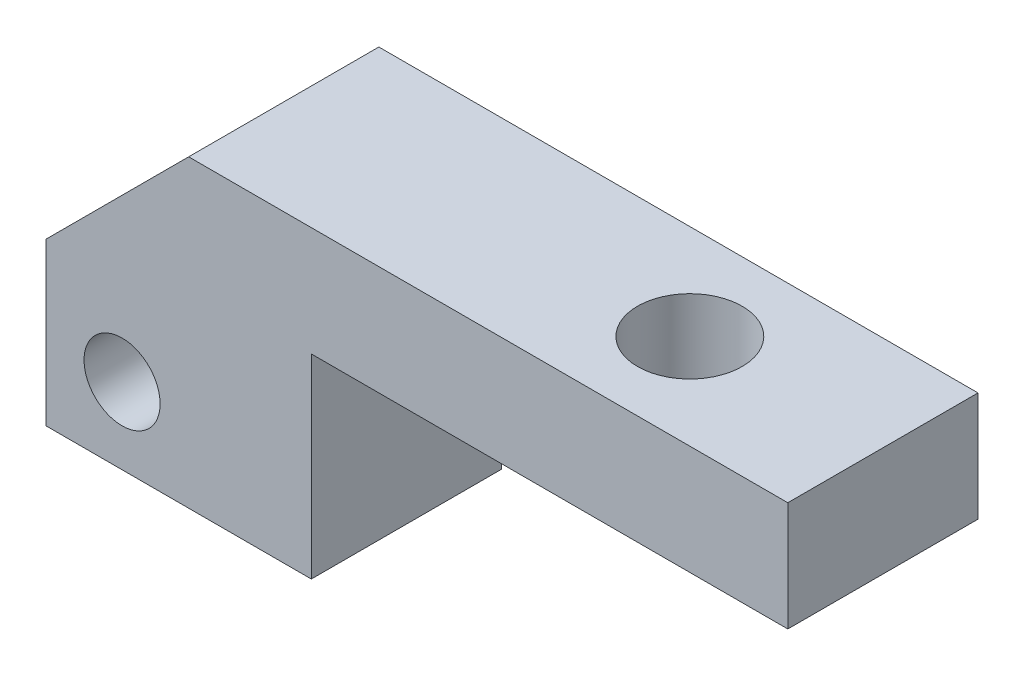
ISO-10303-21;
HEADER;
FILE_DESCRIPTION(('STEP AP214'),'2;1');
FILE_NAME('part.step','',(''),(''),'','','');
FILE_SCHEMA(('AUTOMOTIVE_DESIGN { 1 0 10303 214 1 1 1 1 }'));
ENDSEC;
DATA;
#1=APPLICATION_CONTEXT('core data for automotive mechanical design processes');
#2=APPLICATION_PROTOCOL_DEFINITION('international standard','automotive_design',2000,#1);
#3=PRODUCT_CONTEXT('',#1,'mechanical');
#4=PRODUCT('Part','Part','',(#3));
#5=PRODUCT_RELATED_PRODUCT_CATEGORY('part','',(#4));
#6=PRODUCT_DEFINITION_FORMATION('','',#4);
#7=PRODUCT_DEFINITION_CONTEXT('part definition',#1,'design');
#8=PRODUCT_DEFINITION('design','',#6,#7);
#9=PRODUCT_DEFINITION_SHAPE('','',#8);
#10=(LENGTH_UNIT() NAMED_UNIT(*) SI_UNIT(.MILLI.,.METRE.));
#11=(NAMED_UNIT(*) PLANE_ANGLE_UNIT() SI_UNIT($,.RADIAN.));
#12=(NAMED_UNIT(*) SI_UNIT($,.STERADIAN.) SOLID_ANGLE_UNIT());
#13=UNCERTAINTY_MEASURE_WITH_UNIT(LENGTH_MEASURE(1.E-05),#10,'distance_accuracy_value','');
#14=(GEOMETRIC_REPRESENTATION_CONTEXT(3) GLOBAL_UNCERTAINTY_ASSIGNED_CONTEXT((#13)) GLOBAL_UNIT_ASSIGNED_CONTEXT((#10,
#11,#12)) REPRESENTATION_CONTEXT('',''));
#15=CARTESIAN_POINT('',(0.,0.,0.));
#16=DIRECTION('',(0.,0.,1.));
#17=DIRECTION('',(1.,0.,0.));
#18=AXIS2_PLACEMENT_3D('',#15,#16,#17);
#19=CARTESIAN_POINT('',(0.,32.,10.));
#20=DIRECTION('',(0.,0.,1.));
#21=DIRECTION('',(1.,0.,0.));
#22=AXIS2_PLACEMENT_3D('',#19,#20,#21);
#23=PLANE('',#22);
#24=DIRECTION('',(-1.,0.,0.));
#25=VECTOR('',#24,1.);
#26=CARTESIAN_POINT('',(-27.9,32.,10.));
#27=LINE('',#26,#25);
#28=CARTESIAN_POINT('',(50.1,32.,10.));
#29=VERTEX_POINT('',#28);
#30=CARTESIAN_POINT('',(-12.9,32.,10.));
#31=VERTEX_POINT('',#30);
#32=EDGE_CURVE('E130',#29,#31,#27,.T.);
#33=ORIENTED_EDGE('',*,*,#32,.T.);
#34=DIRECTION('',(0.707106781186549,0.707106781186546,0.));
#35=VECTOR('',#34,1.);
#36=CARTESIAN_POINT('',(-6.44999999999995,38.45,10.));
#37=LINE('',#36,#35);
#38=CARTESIAN_POINT('',(-27.9,17.,10.));
#39=VERTEX_POINT('',#38);
#40=EDGE_CURVE('E11',#31,#39,#37,.F.);
#41=ORIENTED_EDGE('',*,*,#40,.T.);
#42=DIRECTION('',(0.,-1.,0.));
#43=VECTOR('',#42,1.);
#44=CARTESIAN_POINT('',(-27.9,0.,10.));
#45=LINE('',#44,#43);
#46=CARTESIAN_POINT('',(-27.9,0.,10.));
#47=VERTEX_POINT('',#46);
#48=EDGE_CURVE('E132',#39,#47,#45,.T.);
#49=ORIENTED_EDGE('',*,*,#48,.T.);
#50=DIRECTION('',(1.,0.,0.));
#51=VECTOR('',#50,1.);
#52=CARTESIAN_POINT('',(0.,0.,10.));
#53=LINE('',#52,#51);
#54=CARTESIAN_POINT('',(0.,0.,10.));
#55=VERTEX_POINT('',#54);
#56=EDGE_CURVE('E134',#47,#55,#53,.T.);
#57=ORIENTED_EDGE('',*,*,#56,.T.);
#58=DIRECTION('',(0.,1.,0.));
#59=VECTOR('',#58,1.);
#60=CARTESIAN_POINT('',(0.,20.5,10.));
#61=LINE('',#60,#59);
#62=CARTESIAN_POINT('',(0.,20.5,10.));
#63=VERTEX_POINT('',#62);
#64=EDGE_CURVE('E125',#55,#63,#61,.T.);
#65=ORIENTED_EDGE('',*,*,#64,.T.);
#66=DIRECTION('',(1.,0.,0.));
#67=VECTOR('',#66,1.);
#68=CARTESIAN_POINT('',(50.1,20.5,10.));
#69=LINE('',#68,#67);
#70=CARTESIAN_POINT('',(50.1,20.5,10.));
#71=VERTEX_POINT('',#70);
#72=EDGE_CURVE('E101',#63,#71,#69,.T.);
#73=ORIENTED_EDGE('',*,*,#72,.T.);
#74=DIRECTION('',(0.,1.,0.));
#75=VECTOR('',#74,1.);
#76=CARTESIAN_POINT('',(50.1,32.,10.));
#77=LINE('',#76,#75);
#78=EDGE_CURVE('E128',#71,#29,#77,.T.);
#79=ORIENTED_EDGE('',*,*,#78,.T.);
#80=EDGE_LOOP('',(#33,#41,#49,#57,#65,#73,#79));
#81=FACE_BOUND('',#80,.T.);
#82=CARTESIAN_POINT('',(-19.9,8.,10.));
#83=DIRECTION('',(0.,0.,1.));
#84=DIRECTION('',(1.,0.,0.));
#85=AXIS2_PLACEMENT_3D('',#82,#83,#84);
#86=CIRCLE('',#85,4.);
#87=CARTESIAN_POINT('',(-15.9,8.,10.));
#88=VERTEX_POINT('',#87);
#89=EDGE_CURVE('E111',#88,#88,#86,.T.);
#90=ORIENTED_EDGE('',*,*,#89,.F.);
#91=EDGE_LOOP('',(#90));
#92=FACE_BOUND('',#91,.T.);
#93=ADVANCED_FACE('F28',(#81,#92),#23,.T.);
#94=CARTESIAN_POINT('',(0.,32.,-10.));
#95=DIRECTION('',(0.,0.,1.));
#96=DIRECTION('',(1.,0.,0.));
#97=AXIS2_PLACEMENT_3D('',#94,#95,#96);
#98=PLANE('',#97);
#99=DIRECTION('',(0.,-1.,0.));
#100=VECTOR('',#99,1.);
#101=CARTESIAN_POINT('',(-27.9,0.,-10.));
#102=LINE('',#101,#100);
#103=CARTESIAN_POINT('',(-27.9,17.,-10.));
#104=VERTEX_POINT('',#103);
#105=CARTESIAN_POINT('',(-27.9,0.,-10.));
#106=VERTEX_POINT('',#105);
#107=EDGE_CURVE('E121',#104,#106,#102,.T.);
#108=ORIENTED_EDGE('',*,*,#107,.F.);
#109=DIRECTION('',(-0.707106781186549,-0.707106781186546,0.));
#110=VECTOR('',#109,1.);
#111=CARTESIAN_POINT('',(-27.9,17.,-10.));
#112=LINE('',#111,#110);
#113=CARTESIAN_POINT('',(-12.8999999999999,32.,-10.));
#114=VERTEX_POINT('',#113);
#115=EDGE_CURVE('E50',#104,#114,#112,.F.);
#116=ORIENTED_EDGE('',*,*,#115,.T.);
#117=DIRECTION('',(-1.,0.,0.));
#118=VECTOR('',#117,1.);
#119=CARTESIAN_POINT('',(-27.9,32.,-10.));
#120=LINE('',#119,#118);
#121=CARTESIAN_POINT('',(50.1,32.,-10.));
#122=VERTEX_POINT('',#121);
#123=EDGE_CURVE('E119',#122,#114,#120,.T.);
#124=ORIENTED_EDGE('',*,*,#123,.F.);
#125=DIRECTION('',(0.,1.,0.));
#126=VECTOR('',#125,1.);
#127=CARTESIAN_POINT('',(50.1,32.,-10.));
#128=LINE('',#127,#126);
#129=CARTESIAN_POINT('',(50.1,20.5,-10.));
#130=VERTEX_POINT('',#129);
#131=EDGE_CURVE('E93',#130,#122,#128,.T.);
#132=ORIENTED_EDGE('',*,*,#131,.F.);
#133=DIRECTION('',(1.,0.,0.));
#134=VECTOR('',#133,1.);
#135=CARTESIAN_POINT('',(50.1,20.5,-10.));
#136=LINE('',#135,#134);
#137=CARTESIAN_POINT('',(0.,20.5,-10.));
#138=VERTEX_POINT('',#137);
#139=EDGE_CURVE('E86',#138,#130,#136,.T.);
#140=ORIENTED_EDGE('',*,*,#139,.F.);
#141=DIRECTION('',(0.,1.,0.));
#142=VECTOR('',#141,1.);
#143=CARTESIAN_POINT('',(0.,20.5,-10.));
#144=LINE('',#143,#142);
#145=CARTESIAN_POINT('',(0.,0.,-10.));
#146=VERTEX_POINT('',#145);
#147=EDGE_CURVE('E92',#146,#138,#144,.T.);
#148=ORIENTED_EDGE('',*,*,#147,.F.);
#149=DIRECTION('',(1.,0.,0.));
#150=VECTOR('',#149,1.);
#151=CARTESIAN_POINT('',(0.,0.,-10.));
#152=LINE('',#151,#150);
#153=EDGE_CURVE('E123',#106,#146,#152,.T.);
#154=ORIENTED_EDGE('',*,*,#153,.F.);
#155=EDGE_LOOP('',(#108,#116,#124,#132,#140,#148,#154));
#156=FACE_BOUND('',#155,.T.);
#157=CARTESIAN_POINT('',(-19.9,8.,-10.));
#158=DIRECTION('',(0.,0.,1.));
#159=DIRECTION('',(1.,0.,0.));
#160=AXIS2_PLACEMENT_3D('',#157,#158,#159);
#161=CIRCLE('',#160,4.);
#162=CARTESIAN_POINT('',(-15.9,8.,-10.));
#163=VERTEX_POINT('',#162);
#164=EDGE_CURVE('E114',#163,#163,#161,.T.);
#165=ORIENTED_EDGE('',*,*,#164,.T.);
#166=EDGE_LOOP('',(#165));
#167=FACE_BOUND('',#166,.T.);
#168=ADVANCED_FACE('F88',(#156,#167),#98,.F.);
#169=CARTESIAN_POINT('',(0.,20.5,10.));
#170=DIRECTION('',(-1.,0.,0.));
#171=DIRECTION('',(0.,-1.,0.));
#172=AXIS2_PLACEMENT_3D('',#169,#170,#171);
#173=PLANE('',#172);
#174=ORIENTED_EDGE('',*,*,#147,.T.);
#175=DIRECTION('',(0.,0.,-1.));
#176=VECTOR('',#175,1.);
#177=CARTESIAN_POINT('',(0.,20.5,10.));
#178=LINE('',#177,#176);
#179=EDGE_CURVE('E99',#63,#138,#178,.T.);
#180=ORIENTED_EDGE('',*,*,#179,.F.);
#181=ORIENTED_EDGE('',*,*,#64,.F.);
#182=DIRECTION('',(0.,0.,-1.));
#183=VECTOR('',#182,1.);
#184=CARTESIAN_POINT('',(0.,0.,10.));
#185=LINE('',#184,#183);
#186=EDGE_CURVE('E110',#55,#146,#185,.T.);
#187=ORIENTED_EDGE('',*,*,#186,.T.);
#188=EDGE_LOOP('',(#174,#180,#181,#187));
#189=FACE_BOUND('',#188,.T.);
#190=ADVANCED_FACE('F30',(#189),#173,.F.);
#191=CARTESIAN_POINT('',(50.1,20.5,10.));
#192=DIRECTION('',(0.,1.,0.));
#193=DIRECTION('',(-1.,0.,0.));
#194=AXIS2_PLACEMENT_3D('',#191,#192,#193);
#195=PLANE('',#194);
#196=CARTESIAN_POINT('',(29.8,20.5,0.));
#197=DIRECTION('',(0.,1.,0.));
#198=DIRECTION('',(-1.,0.,0.));
#199=AXIS2_PLACEMENT_3D('',#196,#197,#198);
#200=CIRCLE('',#199,5.5);
#201=CARTESIAN_POINT('',(24.3,20.5,0.));
#202=VERTEX_POINT('',#201);
#203=EDGE_CURVE('E196',#202,#202,#200,.F.);
#204=ORIENTED_EDGE('',*,*,#203,.F.);
#205=EDGE_LOOP('',(#204));
#206=FACE_BOUND('',#205,.T.);
#207=ORIENTED_EDGE('',*,*,#139,.T.);
#208=DIRECTION('',(0.,0.,-1.));
#209=VECTOR('',#208,1.);
#210=CARTESIAN_POINT('',(50.1,20.5,10.));
#211=LINE('',#210,#209);
#212=EDGE_CURVE('E106',#71,#130,#211,.T.);
#213=ORIENTED_EDGE('',*,*,#212,.F.);
#214=ORIENTED_EDGE('',*,*,#72,.F.);
#215=ORIENTED_EDGE('',*,*,#179,.T.);
#216=EDGE_LOOP('',(#207,#213,#214,#215));
#217=FACE_BOUND('',#216,.T.);
#218=ADVANCED_FACE('F100',(#206,#217),#195,.F.);
#219=CARTESIAN_POINT('',(50.1,32.,10.));
#220=DIRECTION('',(-1.,0.,0.));
#221=DIRECTION('',(0.,0.,1.));
#222=AXIS2_PLACEMENT_3D('',#219,#220,#221);
#223=PLANE('',#222);
#224=ORIENTED_EDGE('',*,*,#131,.T.);
#225=DIRECTION('',(0.,0.,-1.));
#226=VECTOR('',#225,1.);
#227=CARTESIAN_POINT('',(50.1,32.,10.));
#228=LINE('',#227,#226);
#229=EDGE_CURVE('E140',#29,#122,#228,.T.);
#230=ORIENTED_EDGE('',*,*,#229,.F.);
#231=ORIENTED_EDGE('',*,*,#78,.F.);
#232=ORIENTED_EDGE('',*,*,#212,.T.);
#233=EDGE_LOOP('',(#224,#230,#231,#232));
#234=FACE_BOUND('',#233,.T.);
#235=ADVANCED_FACE('F186',(#234),#223,.F.);
#236=CARTESIAN_POINT('',(-27.9,32.,10.));
#237=DIRECTION('',(0.,-1.,0.));
#238=DIRECTION('',(0.,0.,-1.));
#239=AXIS2_PLACEMENT_3D('',#236,#237,#238);
#240=PLANE('',#239);
#241=CARTESIAN_POINT('',(29.8,32.,0.));
#242=DIRECTION('',(0.,1.,0.));
#243=DIRECTION('',(0.,0.,1.));
#244=AXIS2_PLACEMENT_3D('',#241,#242,#243);
#245=CIRCLE('',#244,5.5);
#246=CARTESIAN_POINT('',(29.8,32.,5.5));
#247=VERTEX_POINT('',#246);
#248=EDGE_CURVE('E198',#247,#247,#245,.T.);
#249=ORIENTED_EDGE('',*,*,#248,.F.);
#250=EDGE_LOOP('',(#249));
#251=FACE_BOUND('',#250,.T.);
#252=ORIENTED_EDGE('',*,*,#123,.T.);
#253=DIRECTION('',(0.,0.,1.));
#254=VECTOR('',#253,1.);
#255=CARTESIAN_POINT('',(-12.8999999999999,32.,10.));
#256=LINE('',#255,#254);
#257=EDGE_CURVE('E36',#114,#31,#256,.T.);
#258=ORIENTED_EDGE('',*,*,#257,.T.);
#259=ORIENTED_EDGE('',*,*,#32,.F.);
#260=ORIENTED_EDGE('',*,*,#229,.T.);
#261=EDGE_LOOP('',(#252,#258,#259,#260));
#262=FACE_BOUND('',#261,.T.);
#263=ADVANCED_FACE('F183',(#251,#262),#240,.F.);
#264=CARTESIAN_POINT('',(-27.9,0.,10.));
#265=DIRECTION('',(1.,0.,0.));
#266=DIRECTION('',(0.,0.,-1.));
#267=AXIS2_PLACEMENT_3D('',#264,#265,#266);
#268=PLANE('',#267);
#269=ORIENTED_EDGE('',*,*,#48,.F.);
#270=DIRECTION('',(0.,0.,-1.));
#271=VECTOR('',#270,1.);
#272=CARTESIAN_POINT('',(-27.9,17.,10.));
#273=LINE('',#272,#271);
#274=EDGE_CURVE('E105',#39,#104,#273,.T.);
#275=ORIENTED_EDGE('',*,*,#274,.T.);
#276=ORIENTED_EDGE('',*,*,#107,.T.);
#277=DIRECTION('',(0.,0.,-1.));
#278=VECTOR('',#277,1.);
#279=CARTESIAN_POINT('',(-27.9,0.,10.));
#280=LINE('',#279,#278);
#281=EDGE_CURVE('E137',#47,#106,#280,.T.);
#282=ORIENTED_EDGE('',*,*,#281,.F.);
#283=EDGE_LOOP('',(#269,#275,#276,#282));
#284=FACE_BOUND('',#283,.T.);
#285=ADVANCED_FACE('F149',(#284),#268,.F.);
#286=CARTESIAN_POINT('',(0.,0.,10.));
#287=DIRECTION('',(0.,1.,0.));
#288=DIRECTION('',(-1.,0.,0.));
#289=AXIS2_PLACEMENT_3D('',#286,#287,#288);
#290=PLANE('',#289);
#291=ORIENTED_EDGE('',*,*,#153,.T.);
#292=ORIENTED_EDGE('',*,*,#186,.F.);
#293=ORIENTED_EDGE('',*,*,#56,.F.);
#294=ORIENTED_EDGE('',*,*,#281,.T.);
#295=EDGE_LOOP('',(#291,#292,#293,#294));
#296=FACE_BOUND('',#295,.T.);
#297=ADVANCED_FACE('F154',(#296),#290,.F.);
#298=CARTESIAN_POINT('',(-19.9,8.,10.));
#299=DIRECTION('',(0.,0.,-1.));
#300=DIRECTION('',(-1.,0.,0.));
#301=AXIS2_PLACEMENT_3D('',#298,#299,#300);
#302=CYLINDRICAL_SURFACE('',#301,4.);
#303=ORIENTED_EDGE('',*,*,#89,.T.);
#304=EDGE_LOOP('',(#303));
#305=FACE_BOUND('',#304,.T.);
#306=ORIENTED_EDGE('',*,*,#164,.F.);
#307=EDGE_LOOP('',(#306));
#308=FACE_BOUND('',#307,.T.);
#309=ADVANCED_FACE('F161',(#305,#308),#302,.F.);
#310=CARTESIAN_POINT('',(-27.9,17.,10.));
#311=DIRECTION('',(0.707106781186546,-0.707106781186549,0.));
#312=DIRECTION('',(0.707106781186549,0.707106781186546,0.));
#313=AXIS2_PLACEMENT_3D('',#310,#311,#312);
#314=PLANE('',#313);
#315=ORIENTED_EDGE('',*,*,#40,.F.);
#316=ORIENTED_EDGE('',*,*,#257,.F.);
#317=ORIENTED_EDGE('',*,*,#115,.F.);
#318=ORIENTED_EDGE('',*,*,#274,.F.);
#319=EDGE_LOOP('',(#315,#316,#317,#318));
#320=FACE_BOUND('',#319,.T.);
#321=ADVANCED_FACE('F158',(#320),#314,.F.);
#322=CARTESIAN_POINT('',(29.8,-0.001000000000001,0.));
#323=DIRECTION('',(0.,1.,0.));
#324=DIRECTION('',(0.,0.,1.));
#325=AXIS2_PLACEMENT_3D('',#322,#323,#324);
#326=CYLINDRICAL_SURFACE('',#325,5.5);
#327=ORIENTED_EDGE('',*,*,#248,.T.);
#328=EDGE_LOOP('',(#327));
#329=FACE_BOUND('',#328,.T.);
#330=ORIENTED_EDGE('',*,*,#203,.T.);
#331=EDGE_LOOP('',(#330));
#332=FACE_BOUND('',#331,.T.);
#333=ADVANCED_FACE('F160',(#329,#332),#326,.F.);
#334=CLOSED_SHELL('',(#93,#168,#190,#218,#235,#263,#285,#297,#309,#321,#333));
#335=MANIFOLD_SOLID_BREP('B2',#334);
#336=ADVANCED_BREP_SHAPE_REPRESENTATION('',(#18,#335),#14);
#337=SHAPE_DEFINITION_REPRESENTATION(#9,#336);
ENDSEC;
END-ISO-10303-21;
